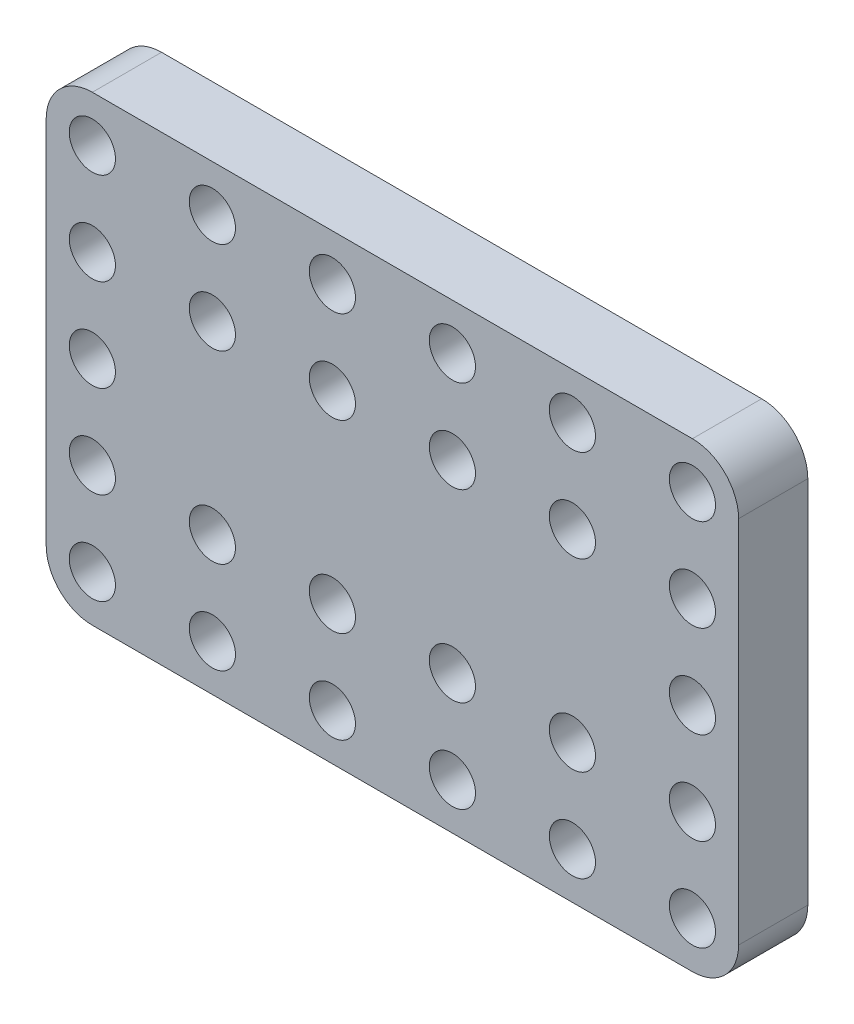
ISO-10303-21;
HEADER;
FILE_DESCRIPTION(('STEP AP214'),'2;1');
FILE_NAME('part.step','',(''),(''),'','','');
FILE_SCHEMA(('AUTOMOTIVE_DESIGN { 1 0 10303 214 1 1 1 1 }'));
ENDSEC;
DATA;
#1=APPLICATION_CONTEXT('core data for automotive mechanical design processes');
#2=APPLICATION_PROTOCOL_DEFINITION('international standard','automotive_design',2000,#1);
#3=PRODUCT_CONTEXT('',#1,'mechanical');
#4=PRODUCT('Part','Part','',(#3));
#5=PRODUCT_RELATED_PRODUCT_CATEGORY('part','',(#4));
#6=PRODUCT_DEFINITION_FORMATION('','',#4);
#7=PRODUCT_DEFINITION_CONTEXT('part definition',#1,'design');
#8=PRODUCT_DEFINITION('design','',#6,#7);
#9=PRODUCT_DEFINITION_SHAPE('','',#8);
#10=(LENGTH_UNIT() NAMED_UNIT(*) SI_UNIT(.MILLI.,.METRE.));
#11=(NAMED_UNIT(*) PLANE_ANGLE_UNIT() SI_UNIT($,.RADIAN.));
#12=(NAMED_UNIT(*) SI_UNIT($,.STERADIAN.) SOLID_ANGLE_UNIT());
#13=UNCERTAINTY_MEASURE_WITH_UNIT(LENGTH_MEASURE(1.E-05),#10,'distance_accuracy_value','');
#14=(GEOMETRIC_REPRESENTATION_CONTEXT(3) GLOBAL_UNCERTAINTY_ASSIGNED_CONTEXT((#13)) GLOBAL_UNIT_ASSIGNED_CONTEXT((#10,
#11,#12)) REPRESENTATION_CONTEXT('',''));
#15=CARTESIAN_POINT('',(0.,0.,0.));
#16=DIRECTION('',(0.,0.,1.));
#17=DIRECTION('',(1.,0.,0.));
#18=AXIS2_PLACEMENT_3D('',#15,#16,#17);
#19=CARTESIAN_POINT('',(10.,90.,7.5));
#20=DIRECTION('',(0.,0.,-1.));
#21=DIRECTION('',(-1.,0.,0.));
#22=AXIS2_PLACEMENT_3D('',#19,#20,#21);
#23=PLANE('',#22);
#24=CARTESIAN_POINT('',(114.,90.,7.5));
#25=DIRECTION('',(0.,0.,1.));
#26=DIRECTION('',(1.,0.,0.));
#27=AXIS2_PLACEMENT_3D('',#24,#25,#26);
#28=CIRCLE('',#27,5.00000000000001);
#29=CARTESIAN_POINT('',(119.,90.,7.5));
#30=VERTEX_POINT('',#29);
#31=EDGE_CURVE('E320',#30,#30,#28,.T.);
#32=ORIENTED_EDGE('',*,*,#31,.F.);
#33=EDGE_LOOP('',(#32));
#34=FACE_BOUND('',#33,.T.);
#35=CARTESIAN_POINT('',(62.,90.,7.5));
#36=DIRECTION('',(0.,0.,1.));
#37=DIRECTION('',(1.,0.,0.));
#38=AXIS2_PLACEMENT_3D('',#35,#36,#37);
#39=CIRCLE('',#38,5.00000000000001);
#40=CARTESIAN_POINT('',(67.,90.,7.5));
#41=VERTEX_POINT('',#40);
#42=EDGE_CURVE('E308',#41,#41,#39,.T.);
#43=ORIENTED_EDGE('',*,*,#42,.F.);
#44=EDGE_LOOP('',(#43));
#45=FACE_BOUND('',#44,.T.);
#46=CARTESIAN_POINT('',(10.,90.,7.5));
#47=DIRECTION('',(0.,0.,1.));
#48=DIRECTION('',(1.,0.,0.));
#49=AXIS2_PLACEMENT_3D('',#46,#47,#48);
#50=CIRCLE('',#49,5.);
#51=CARTESIAN_POINT('',(15.,90.,7.5));
#52=VERTEX_POINT('',#51);
#53=EDGE_CURVE('E296',#52,#52,#50,.T.);
#54=ORIENTED_EDGE('',*,*,#53,.F.);
#55=EDGE_LOOP('',(#54));
#56=FACE_BOUND('',#55,.T.);
#57=CARTESIAN_POINT('',(114.,70.,7.5));
#58=DIRECTION('',(0.,0.,1.));
#59=DIRECTION('',(1.,0.,0.));
#60=AXIS2_PLACEMENT_3D('',#57,#58,#59);
#61=CIRCLE('',#60,5.00000000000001);
#62=CARTESIAN_POINT('',(119.,70.,7.5));
#63=VERTEX_POINT('',#62);
#64=EDGE_CURVE('E284',#63,#63,#61,.T.);
#65=ORIENTED_EDGE('',*,*,#64,.F.);
#66=EDGE_LOOP('',(#65));
#67=FACE_BOUND('',#66,.T.);
#68=CARTESIAN_POINT('',(62.,70.,7.5));
#69=DIRECTION('',(0.,0.,1.));
#70=DIRECTION('',(1.,0.,0.));
#71=AXIS2_PLACEMENT_3D('',#68,#69,#70);
#72=CIRCLE('',#71,5.00000000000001);
#73=CARTESIAN_POINT('',(67.,70.,7.5));
#74=VERTEX_POINT('',#73);
#75=EDGE_CURVE('E272',#74,#74,#72,.T.);
#76=ORIENTED_EDGE('',*,*,#75,.F.);
#77=EDGE_LOOP('',(#76));
#78=FACE_BOUND('',#77,.T.);
#79=CARTESIAN_POINT('',(10.,70.,7.5));
#80=DIRECTION('',(0.,0.,1.));
#81=DIRECTION('',(1.,0.,0.));
#82=AXIS2_PLACEMENT_3D('',#79,#80,#81);
#83=CIRCLE('',#82,5.);
#84=CARTESIAN_POINT('',(15.,70.,7.5));
#85=VERTEX_POINT('',#84);
#86=EDGE_CURVE('E260',#85,#85,#83,.T.);
#87=ORIENTED_EDGE('',*,*,#86,.F.);
#88=EDGE_LOOP('',(#87));
#89=FACE_BOUND('',#88,.T.);
#90=CARTESIAN_POINT('',(10.,50.,7.5));
#91=DIRECTION('',(0.,0.,1.));
#92=DIRECTION('',(1.,0.,0.));
#93=AXIS2_PLACEMENT_3D('',#90,#91,#92);
#94=CIRCLE('',#93,5.);
#95=CARTESIAN_POINT('',(15.,50.,7.5));
#96=VERTEX_POINT('',#95);
#97=EDGE_CURVE('E248',#96,#96,#94,.T.);
#98=ORIENTED_EDGE('',*,*,#97,.F.);
#99=EDGE_LOOP('',(#98));
#100=FACE_BOUND('',#99,.T.);
#101=CARTESIAN_POINT('',(114.,30.,7.5));
#102=DIRECTION('',(0.,0.,1.));
#103=DIRECTION('',(1.,0.,0.));
#104=AXIS2_PLACEMENT_3D('',#101,#102,#103);
#105=CIRCLE('',#104,5.00000000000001);
#106=CARTESIAN_POINT('',(119.,30.,7.5));
#107=VERTEX_POINT('',#106);
#108=EDGE_CURVE('E236',#107,#107,#105,.T.);
#109=ORIENTED_EDGE('',*,*,#108,.F.);
#110=EDGE_LOOP('',(#109));
#111=FACE_BOUND('',#110,.T.);
#112=CARTESIAN_POINT('',(62.,30.,7.5));
#113=DIRECTION('',(0.,0.,1.));
#114=DIRECTION('',(1.,0.,0.));
#115=AXIS2_PLACEMENT_3D('',#112,#113,#114);
#116=CIRCLE('',#115,5.);
#117=CARTESIAN_POINT('',(67.,30.,7.5));
#118=VERTEX_POINT('',#117);
#119=EDGE_CURVE('E224',#118,#118,#116,.T.);
#120=ORIENTED_EDGE('',*,*,#119,.F.);
#121=EDGE_LOOP('',(#120));
#122=FACE_BOUND('',#121,.T.);
#123=CARTESIAN_POINT('',(10.,30.,7.5));
#124=DIRECTION('',(0.,0.,1.));
#125=DIRECTION('',(1.,0.,0.));
#126=AXIS2_PLACEMENT_3D('',#123,#124,#125);
#127=CIRCLE('',#126,5.);
#128=CARTESIAN_POINT('',(15.,30.,7.5));
#129=VERTEX_POINT('',#128);
#130=EDGE_CURVE('E212',#129,#129,#127,.T.);
#131=ORIENTED_EDGE('',*,*,#130,.F.);
#132=EDGE_LOOP('',(#131));
#133=FACE_BOUND('',#132,.T.);
#134=CARTESIAN_POINT('',(114.,10.,7.5));
#135=DIRECTION('',(0.,0.,1.));
#136=DIRECTION('',(1.,0.,0.));
#137=AXIS2_PLACEMENT_3D('',#134,#135,#136);
#138=CIRCLE('',#137,5.);
#139=CARTESIAN_POINT('',(119.,10.,7.5));
#140=VERTEX_POINT('',#139);
#141=EDGE_CURVE('E200',#140,#140,#138,.T.);
#142=ORIENTED_EDGE('',*,*,#141,.F.);
#143=EDGE_LOOP('',(#142));
#144=FACE_BOUND('',#143,.T.);
#145=CARTESIAN_POINT('',(62.,10.,7.5));
#146=DIRECTION('',(0.,0.,1.));
#147=DIRECTION('',(1.,0.,0.));
#148=AXIS2_PLACEMENT_3D('',#145,#146,#147);
#149=CIRCLE('',#148,5.);
#150=CARTESIAN_POINT('',(67.,10.,7.5));
#151=VERTEX_POINT('',#150);
#152=EDGE_CURVE('E188',#151,#151,#149,.T.);
#153=ORIENTED_EDGE('',*,*,#152,.F.);
#154=EDGE_LOOP('',(#153));
#155=FACE_BOUND('',#154,.T.);
#156=CARTESIAN_POINT('',(10.,10.,7.5));
#157=DIRECTION('',(0.,0.,1.));
#158=DIRECTION('',(1.,0.,0.));
#159=AXIS2_PLACEMENT_3D('',#156,#157,#158);
#160=CIRCLE('',#159,5.);
#161=CARTESIAN_POINT('',(15.,10.,7.5));
#162=VERTEX_POINT('',#161);
#163=EDGE_CURVE('E134',#162,#162,#160,.T.);
#164=ORIENTED_EDGE('',*,*,#163,.F.);
#165=EDGE_LOOP('',(#164));
#166=FACE_BOUND('',#165,.T.);
#167=CARTESIAN_POINT('',(10.,90.,7.5));
#168=DIRECTION('',(0.,0.,1.));
#169=DIRECTION('',(-1.,0.,0.));
#170=AXIS2_PLACEMENT_3D('',#167,#168,#169);
#171=CIRCLE('',#170,9.99999999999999);
#172=CARTESIAN_POINT('',(10.,100.,7.5));
#173=VERTEX_POINT('',#172);
#174=CARTESIAN_POINT('',(0.,90.,7.5));
#175=VERTEX_POINT('',#174);
#176=EDGE_CURVE('E145',#173,#175,#171,.T.);
#177=ORIENTED_EDGE('',*,*,#176,.T.);
#178=DIRECTION('',(0.,-1.,0.));
#179=VECTOR('',#178,1.);
#180=CARTESIAN_POINT('',(0.,10.,7.5));
#181=LINE('',#180,#179);
#182=CARTESIAN_POINT('',(0.,10.,7.5));
#183=VERTEX_POINT('',#182);
#184=EDGE_CURVE('E93',#175,#183,#181,.T.);
#185=ORIENTED_EDGE('',*,*,#184,.T.);
#186=CARTESIAN_POINT('',(10.,10.,7.5));
#187=DIRECTION('',(0.,0.,1.));
#188=DIRECTION('',(1.,0.,0.));
#189=AXIS2_PLACEMENT_3D('',#186,#187,#188);
#190=CIRCLE('',#189,10.);
#191=CARTESIAN_POINT('',(10.,0.,7.5));
#192=VERTEX_POINT('',#191);
#193=EDGE_CURVE('E160',#183,#192,#190,.T.);
#194=ORIENTED_EDGE('',*,*,#193,.T.);
#195=DIRECTION('',(1.,0.,0.));
#196=VECTOR('',#195,1.);
#197=CARTESIAN_POINT('',(10.,0.,7.5));
#198=LINE('',#197,#196);
#199=CARTESIAN_POINT('',(140.,0.,7.5));
#200=VERTEX_POINT('',#199);
#201=EDGE_CURVE('E173',#192,#200,#198,.T.);
#202=ORIENTED_EDGE('',*,*,#201,.T.);
#203=CARTESIAN_POINT('',(140.,10.,7.5));
#204=DIRECTION('',(0.,0.,1.));
#205=DIRECTION('',(-1.,0.,0.));
#206=AXIS2_PLACEMENT_3D('',#203,#204,#205);
#207=CIRCLE('',#206,9.99999999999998);
#208=CARTESIAN_POINT('',(150.,10.,7.5));
#209=VERTEX_POINT('',#208);
#210=EDGE_CURVE('E112',#200,#209,#207,.T.);
#211=ORIENTED_EDGE('',*,*,#210,.T.);
#212=DIRECTION('',(0.,1.,0.));
#213=VECTOR('',#212,1.);
#214=CARTESIAN_POINT('',(150.,10.,7.5));
#215=LINE('',#214,#213);
#216=CARTESIAN_POINT('',(150.,90.,7.5));
#217=VERTEX_POINT('',#216);
#218=EDGE_CURVE('E106',#209,#217,#215,.T.);
#219=ORIENTED_EDGE('',*,*,#218,.T.);
#220=CARTESIAN_POINT('',(140.,90.,7.5));
#221=DIRECTION('',(0.,0.,1.));
#222=DIRECTION('',(1.,0.,0.));
#223=AXIS2_PLACEMENT_3D('',#220,#221,#222);
#224=CIRCLE('',#223,9.99999999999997);
#225=CARTESIAN_POINT('',(140.,100.,7.5));
#226=VERTEX_POINT('',#225);
#227=EDGE_CURVE('E110',#217,#226,#224,.T.);
#228=ORIENTED_EDGE('',*,*,#227,.T.);
#229=DIRECTION('',(-1.,0.,0.));
#230=VECTOR('',#229,1.);
#231=CARTESIAN_POINT('',(10.,100.,7.5));
#232=LINE('',#231,#230);
#233=EDGE_CURVE('E50',#226,#173,#232,.T.);
#234=ORIENTED_EDGE('',*,*,#233,.T.);
#235=EDGE_LOOP('',(#177,#185,#194,#202,#211,#219,#228,#234));
#236=FACE_BOUND('',#235,.T.);
#237=CARTESIAN_POINT('',(36.,10.,7.5));
#238=DIRECTION('',(0.,0.,1.));
#239=DIRECTION('',(1.,0.,0.));
#240=AXIS2_PLACEMENT_3D('',#237,#238,#239);
#241=CIRCLE('',#240,5.);
#242=CARTESIAN_POINT('',(41.,10.,7.5));
#243=VERTEX_POINT('',#242);
#244=EDGE_CURVE('E182',#243,#243,#241,.T.);
#245=ORIENTED_EDGE('',*,*,#244,.F.);
#246=EDGE_LOOP('',(#245));
#247=FACE_BOUND('',#246,.T.);
#248=CARTESIAN_POINT('',(88.,10.,7.5));
#249=DIRECTION('',(0.,0.,1.));
#250=DIRECTION('',(1.,0.,0.));
#251=AXIS2_PLACEMENT_3D('',#248,#249,#250);
#252=CIRCLE('',#251,5.);
#253=CARTESIAN_POINT('',(93.,10.,7.5));
#254=VERTEX_POINT('',#253);
#255=EDGE_CURVE('E194',#254,#254,#252,.T.);
#256=ORIENTED_EDGE('',*,*,#255,.F.);
#257=EDGE_LOOP('',(#256));
#258=FACE_BOUND('',#257,.T.);
#259=CARTESIAN_POINT('',(140.,10.,7.5));
#260=DIRECTION('',(0.,0.,1.));
#261=DIRECTION('',(1.,0.,0.));
#262=AXIS2_PLACEMENT_3D('',#259,#260,#261);
#263=CIRCLE('',#262,4.99999999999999);
#264=CARTESIAN_POINT('',(145.,10.,7.5));
#265=VERTEX_POINT('',#264);
#266=EDGE_CURVE('E206',#265,#265,#263,.T.);
#267=ORIENTED_EDGE('',*,*,#266,.F.);
#268=EDGE_LOOP('',(#267));
#269=FACE_BOUND('',#268,.T.);
#270=CARTESIAN_POINT('',(36.,30.,7.5));
#271=DIRECTION('',(0.,0.,1.));
#272=DIRECTION('',(1.,0.,0.));
#273=AXIS2_PLACEMENT_3D('',#270,#271,#272);
#274=CIRCLE('',#273,5.);
#275=CARTESIAN_POINT('',(41.,30.,7.5));
#276=VERTEX_POINT('',#275);
#277=EDGE_CURVE('E218',#276,#276,#274,.T.);
#278=ORIENTED_EDGE('',*,*,#277,.F.);
#279=EDGE_LOOP('',(#278));
#280=FACE_BOUND('',#279,.T.);
#281=CARTESIAN_POINT('',(88.,30.,7.5));
#282=DIRECTION('',(0.,0.,1.));
#283=DIRECTION('',(1.,0.,0.));
#284=AXIS2_PLACEMENT_3D('',#281,#282,#283);
#285=CIRCLE('',#284,5.00000000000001);
#286=CARTESIAN_POINT('',(93.,30.,7.5));
#287=VERTEX_POINT('',#286);
#288=EDGE_CURVE('E230',#287,#287,#285,.T.);
#289=ORIENTED_EDGE('',*,*,#288,.F.);
#290=EDGE_LOOP('',(#289));
#291=FACE_BOUND('',#290,.T.);
#292=CARTESIAN_POINT('',(140.,30.,7.5));
#293=DIRECTION('',(0.,0.,1.));
#294=DIRECTION('',(1.,0.,0.));
#295=AXIS2_PLACEMENT_3D('',#292,#293,#294);
#296=CIRCLE('',#295,4.99999999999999);
#297=CARTESIAN_POINT('',(145.,30.,7.5));
#298=VERTEX_POINT('',#297);
#299=EDGE_CURVE('E242',#298,#298,#296,.T.);
#300=ORIENTED_EDGE('',*,*,#299,.F.);
#301=EDGE_LOOP('',(#300));
#302=FACE_BOUND('',#301,.T.);
#303=CARTESIAN_POINT('',(140.,50.,7.5));
#304=DIRECTION('',(0.,0.,1.));
#305=DIRECTION('',(1.,0.,0.));
#306=AXIS2_PLACEMENT_3D('',#303,#304,#305);
#307=CIRCLE('',#306,4.99999999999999);
#308=CARTESIAN_POINT('',(145.,50.,7.5));
#309=VERTEX_POINT('',#308);
#310=EDGE_CURVE('E254',#309,#309,#307,.T.);
#311=ORIENTED_EDGE('',*,*,#310,.F.);
#312=EDGE_LOOP('',(#311));
#313=FACE_BOUND('',#312,.T.);
#314=CARTESIAN_POINT('',(36.,70.,7.5));
#315=DIRECTION('',(0.,0.,1.));
#316=DIRECTION('',(1.,0.,0.));
#317=AXIS2_PLACEMENT_3D('',#314,#315,#316);
#318=CIRCLE('',#317,5.00000000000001);
#319=CARTESIAN_POINT('',(41.,70.,7.5));
#320=VERTEX_POINT('',#319);
#321=EDGE_CURVE('E266',#320,#320,#318,.T.);
#322=ORIENTED_EDGE('',*,*,#321,.F.);
#323=EDGE_LOOP('',(#322));
#324=FACE_BOUND('',#323,.T.);
#325=CARTESIAN_POINT('',(88.,70.,7.5));
#326=DIRECTION('',(0.,0.,1.));
#327=DIRECTION('',(1.,0.,0.));
#328=AXIS2_PLACEMENT_3D('',#325,#326,#327);
#329=CIRCLE('',#328,5.00000000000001);
#330=CARTESIAN_POINT('',(93.,70.,7.5));
#331=VERTEX_POINT('',#330);
#332=EDGE_CURVE('E278',#331,#331,#329,.T.);
#333=ORIENTED_EDGE('',*,*,#332,.F.);
#334=EDGE_LOOP('',(#333));
#335=FACE_BOUND('',#334,.T.);
#336=CARTESIAN_POINT('',(140.,70.,7.5));
#337=DIRECTION('',(0.,0.,1.));
#338=DIRECTION('',(1.,0.,0.));
#339=AXIS2_PLACEMENT_3D('',#336,#337,#338);
#340=CIRCLE('',#339,4.99999999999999);
#341=CARTESIAN_POINT('',(145.,70.,7.5));
#342=VERTEX_POINT('',#341);
#343=EDGE_CURVE('E290',#342,#342,#340,.T.);
#344=ORIENTED_EDGE('',*,*,#343,.F.);
#345=EDGE_LOOP('',(#344));
#346=FACE_BOUND('',#345,.T.);
#347=CARTESIAN_POINT('',(36.,90.,7.5));
#348=DIRECTION('',(0.,0.,1.));
#349=DIRECTION('',(1.,0.,0.));
#350=AXIS2_PLACEMENT_3D('',#347,#348,#349);
#351=CIRCLE('',#350,5.00000000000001);
#352=CARTESIAN_POINT('',(41.,90.,7.5));
#353=VERTEX_POINT('',#352);
#354=EDGE_CURVE('E302',#353,#353,#351,.T.);
#355=ORIENTED_EDGE('',*,*,#354,.F.);
#356=EDGE_LOOP('',(#355));
#357=FACE_BOUND('',#356,.T.);
#358=CARTESIAN_POINT('',(88.,90.,7.5));
#359=DIRECTION('',(0.,0.,1.));
#360=DIRECTION('',(1.,0.,0.));
#361=AXIS2_PLACEMENT_3D('',#358,#359,#360);
#362=CIRCLE('',#361,5.00000000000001);
#363=CARTESIAN_POINT('',(93.,90.,7.5));
#364=VERTEX_POINT('',#363);
#365=EDGE_CURVE('E314',#364,#364,#362,.T.);
#366=ORIENTED_EDGE('',*,*,#365,.F.);
#367=EDGE_LOOP('',(#366));
#368=FACE_BOUND('',#367,.T.);
#369=CARTESIAN_POINT('',(140.,90.,7.5));
#370=DIRECTION('',(0.,0.,1.));
#371=DIRECTION('',(1.,0.,0.));
#372=AXIS2_PLACEMENT_3D('',#369,#370,#371);
#373=CIRCLE('',#372,4.99999999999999);
#374=CARTESIAN_POINT('',(145.,90.,7.5));
#375=VERTEX_POINT('',#374);
#376=EDGE_CURVE('E326',#375,#375,#373,.T.);
#377=ORIENTED_EDGE('',*,*,#376,.F.);
#378=EDGE_LOOP('',(#377));
#379=FACE_BOUND('',#378,.T.);
#380=ADVANCED_FACE('F33',(#34,#45,#56,#67,#78,#89,#100,#111,#122,#133,#144,#155,#166,#236,#247,
#258,#269,#280,#291,#302,#313,#324,#335,#346,#357,#368,#379),#23,.F.);
#381=CARTESIAN_POINT('',(10.,90.,-7.5));
#382=DIRECTION('',(0.,0.,-1.));
#383=DIRECTION('',(-1.,0.,0.));
#384=AXIS2_PLACEMENT_3D('',#381,#382,#383);
#385=PLANE('',#384);
#386=CARTESIAN_POINT('',(114.,90.,-7.5));
#387=DIRECTION('',(0.,0.,1.));
#388=DIRECTION('',(1.,0.,0.));
#389=AXIS2_PLACEMENT_3D('',#386,#387,#388);
#390=CIRCLE('',#389,5.00000000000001);
#391=CARTESIAN_POINT('',(119.,90.,-7.5));
#392=VERTEX_POINT('',#391);
#393=EDGE_CURVE('E323',#392,#392,#390,.T.);
#394=ORIENTED_EDGE('',*,*,#393,.T.);
#395=EDGE_LOOP('',(#394));
#396=FACE_BOUND('',#395,.T.);
#397=CARTESIAN_POINT('',(62.,90.,-7.5));
#398=DIRECTION('',(0.,0.,1.));
#399=DIRECTION('',(1.,0.,0.));
#400=AXIS2_PLACEMENT_3D('',#397,#398,#399);
#401=CIRCLE('',#400,5.00000000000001);
#402=CARTESIAN_POINT('',(67.,90.,-7.5));
#403=VERTEX_POINT('',#402);
#404=EDGE_CURVE('E311',#403,#403,#401,.T.);
#405=ORIENTED_EDGE('',*,*,#404,.T.);
#406=EDGE_LOOP('',(#405));
#407=FACE_BOUND('',#406,.T.);
#408=CARTESIAN_POINT('',(10.,90.,-7.5));
#409=DIRECTION('',(0.,0.,1.));
#410=DIRECTION('',(1.,0.,0.));
#411=AXIS2_PLACEMENT_3D('',#408,#409,#410);
#412=CIRCLE('',#411,5.);
#413=CARTESIAN_POINT('',(15.,90.,-7.5));
#414=VERTEX_POINT('',#413);
#415=EDGE_CURVE('E299',#414,#414,#412,.T.);
#416=ORIENTED_EDGE('',*,*,#415,.T.);
#417=EDGE_LOOP('',(#416));
#418=FACE_BOUND('',#417,.T.);
#419=CARTESIAN_POINT('',(114.,70.,-7.5));
#420=DIRECTION('',(0.,0.,1.));
#421=DIRECTION('',(1.,0.,0.));
#422=AXIS2_PLACEMENT_3D('',#419,#420,#421);
#423=CIRCLE('',#422,5.00000000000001);
#424=CARTESIAN_POINT('',(119.,70.,-7.5));
#425=VERTEX_POINT('',#424);
#426=EDGE_CURVE('E287',#425,#425,#423,.T.);
#427=ORIENTED_EDGE('',*,*,#426,.T.);
#428=EDGE_LOOP('',(#427));
#429=FACE_BOUND('',#428,.T.);
#430=CARTESIAN_POINT('',(62.,70.,-7.5));
#431=DIRECTION('',(0.,0.,1.));
#432=DIRECTION('',(1.,0.,0.));
#433=AXIS2_PLACEMENT_3D('',#430,#431,#432);
#434=CIRCLE('',#433,5.00000000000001);
#435=CARTESIAN_POINT('',(67.,70.,-7.5));
#436=VERTEX_POINT('',#435);
#437=EDGE_CURVE('E275',#436,#436,#434,.T.);
#438=ORIENTED_EDGE('',*,*,#437,.T.);
#439=EDGE_LOOP('',(#438));
#440=FACE_BOUND('',#439,.T.);
#441=CARTESIAN_POINT('',(10.,70.,-7.5));
#442=DIRECTION('',(0.,0.,1.));
#443=DIRECTION('',(1.,0.,0.));
#444=AXIS2_PLACEMENT_3D('',#441,#442,#443);
#445=CIRCLE('',#444,5.);
#446=CARTESIAN_POINT('',(15.,70.,-7.5));
#447=VERTEX_POINT('',#446);
#448=EDGE_CURVE('E263',#447,#447,#445,.T.);
#449=ORIENTED_EDGE('',*,*,#448,.T.);
#450=EDGE_LOOP('',(#449));
#451=FACE_BOUND('',#450,.T.);
#452=CARTESIAN_POINT('',(10.,50.,-7.5));
#453=DIRECTION('',(0.,0.,1.));
#454=DIRECTION('',(1.,0.,0.));
#455=AXIS2_PLACEMENT_3D('',#452,#453,#454);
#456=CIRCLE('',#455,5.);
#457=CARTESIAN_POINT('',(15.,50.,-7.5));
#458=VERTEX_POINT('',#457);
#459=EDGE_CURVE('E251',#458,#458,#456,.T.);
#460=ORIENTED_EDGE('',*,*,#459,.T.);
#461=EDGE_LOOP('',(#460));
#462=FACE_BOUND('',#461,.T.);
#463=CARTESIAN_POINT('',(114.,30.,-7.5));
#464=DIRECTION('',(0.,0.,1.));
#465=DIRECTION('',(1.,0.,0.));
#466=AXIS2_PLACEMENT_3D('',#463,#464,#465);
#467=CIRCLE('',#466,5.00000000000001);
#468=CARTESIAN_POINT('',(119.,30.,-7.5));
#469=VERTEX_POINT('',#468);
#470=EDGE_CURVE('E239',#469,#469,#467,.T.);
#471=ORIENTED_EDGE('',*,*,#470,.T.);
#472=EDGE_LOOP('',(#471));
#473=FACE_BOUND('',#472,.T.);
#474=CARTESIAN_POINT('',(62.,30.,-7.5));
#475=DIRECTION('',(0.,0.,1.));
#476=DIRECTION('',(1.,0.,0.));
#477=AXIS2_PLACEMENT_3D('',#474,#475,#476);
#478=CIRCLE('',#477,5.);
#479=CARTESIAN_POINT('',(67.,30.,-7.5));
#480=VERTEX_POINT('',#479);
#481=EDGE_CURVE('E227',#480,#480,#478,.T.);
#482=ORIENTED_EDGE('',*,*,#481,.T.);
#483=EDGE_LOOP('',(#482));
#484=FACE_BOUND('',#483,.T.);
#485=CARTESIAN_POINT('',(10.,30.,-7.5));
#486=DIRECTION('',(0.,0.,1.));
#487=DIRECTION('',(1.,0.,0.));
#488=AXIS2_PLACEMENT_3D('',#485,#486,#487);
#489=CIRCLE('',#488,5.);
#490=CARTESIAN_POINT('',(15.,30.,-7.5));
#491=VERTEX_POINT('',#490);
#492=EDGE_CURVE('E215',#491,#491,#489,.T.);
#493=ORIENTED_EDGE('',*,*,#492,.T.);
#494=EDGE_LOOP('',(#493));
#495=FACE_BOUND('',#494,.T.);
#496=CARTESIAN_POINT('',(114.,10.,-7.5));
#497=DIRECTION('',(0.,0.,1.));
#498=DIRECTION('',(1.,0.,0.));
#499=AXIS2_PLACEMENT_3D('',#496,#497,#498);
#500=CIRCLE('',#499,5.);
#501=CARTESIAN_POINT('',(119.,10.,-7.5));
#502=VERTEX_POINT('',#501);
#503=EDGE_CURVE('E203',#502,#502,#500,.T.);
#504=ORIENTED_EDGE('',*,*,#503,.T.);
#505=EDGE_LOOP('',(#504));
#506=FACE_BOUND('',#505,.T.);
#507=CARTESIAN_POINT('',(62.,10.,-7.5));
#508=DIRECTION('',(0.,0.,1.));
#509=DIRECTION('',(1.,0.,0.));
#510=AXIS2_PLACEMENT_3D('',#507,#508,#509);
#511=CIRCLE('',#510,5.);
#512=CARTESIAN_POINT('',(67.,10.,-7.5));
#513=VERTEX_POINT('',#512);
#514=EDGE_CURVE('E191',#513,#513,#511,.T.);
#515=ORIENTED_EDGE('',*,*,#514,.T.);
#516=EDGE_LOOP('',(#515));
#517=FACE_BOUND('',#516,.T.);
#518=CARTESIAN_POINT('',(10.,10.,-7.5));
#519=DIRECTION('',(0.,0.,1.));
#520=DIRECTION('',(1.,0.,0.));
#521=AXIS2_PLACEMENT_3D('',#518,#519,#520);
#522=CIRCLE('',#521,5.);
#523=CARTESIAN_POINT('',(15.,10.,-7.5));
#524=VERTEX_POINT('',#523);
#525=EDGE_CURVE('E179',#524,#524,#522,.T.);
#526=ORIENTED_EDGE('',*,*,#525,.T.);
#527=EDGE_LOOP('',(#526));
#528=FACE_BOUND('',#527,.T.);
#529=CARTESIAN_POINT('',(10.,90.,-7.5));
#530=DIRECTION('',(0.,0.,1.));
#531=DIRECTION('',(-1.,0.,0.));
#532=AXIS2_PLACEMENT_3D('',#529,#530,#531);
#533=CIRCLE('',#532,9.99999999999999);
#534=CARTESIAN_POINT('',(10.,100.,-7.5));
#535=VERTEX_POINT('',#534);
#536=CARTESIAN_POINT('',(0.,90.,-7.5));
#537=VERTEX_POINT('',#536);
#538=EDGE_CURVE('E130',#535,#537,#533,.T.);
#539=ORIENTED_EDGE('',*,*,#538,.F.);
#540=DIRECTION('',(-1.,0.,0.));
#541=VECTOR('',#540,1.);
#542=CARTESIAN_POINT('',(10.,100.,-7.5));
#543=LINE('',#542,#541);
#544=CARTESIAN_POINT('',(140.,100.,-7.5));
#545=VERTEX_POINT('',#544);
#546=EDGE_CURVE('E85',#545,#535,#543,.T.);
#547=ORIENTED_EDGE('',*,*,#546,.F.);
#548=CARTESIAN_POINT('',(140.,90.,-7.5));
#549=DIRECTION('',(0.,0.,1.));
#550=DIRECTION('',(1.,0.,0.));
#551=AXIS2_PLACEMENT_3D('',#548,#549,#550);
#552=CIRCLE('',#551,9.99999999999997);
#553=CARTESIAN_POINT('',(150.,90.,-7.5));
#554=VERTEX_POINT('',#553);
#555=EDGE_CURVE('E79',#554,#545,#552,.T.);
#556=ORIENTED_EDGE('',*,*,#555,.F.);
#557=DIRECTION('',(0.,1.,0.));
#558=VECTOR('',#557,1.);
#559=CARTESIAN_POINT('',(150.,10.,-7.5));
#560=LINE('',#559,#558);
#561=CARTESIAN_POINT('',(150.,10.,-7.5));
#562=VERTEX_POINT('',#561);
#563=EDGE_CURVE('E120',#562,#554,#560,.T.);
#564=ORIENTED_EDGE('',*,*,#563,.F.);
#565=CARTESIAN_POINT('',(140.,10.,-7.5));
#566=DIRECTION('',(0.,0.,1.));
#567=DIRECTION('',(-1.,0.,0.));
#568=AXIS2_PLACEMENT_3D('',#565,#566,#567);
#569=CIRCLE('',#568,9.99999999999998);
#570=CARTESIAN_POINT('',(140.,0.,-7.5));
#571=VERTEX_POINT('',#570);
#572=EDGE_CURVE('E140',#571,#562,#569,.T.);
#573=ORIENTED_EDGE('',*,*,#572,.F.);
#574=DIRECTION('',(1.,0.,0.));
#575=VECTOR('',#574,1.);
#576=CARTESIAN_POINT('',(10.,0.,-7.5));
#577=LINE('',#576,#575);
#578=CARTESIAN_POINT('',(10.,0.,-7.5));
#579=VERTEX_POINT('',#578);
#580=EDGE_CURVE('E138',#579,#571,#577,.T.);
#581=ORIENTED_EDGE('',*,*,#580,.F.);
#582=CARTESIAN_POINT('',(10.,10.,-7.5));
#583=DIRECTION('',(0.,0.,1.));
#584=DIRECTION('',(1.,0.,0.));
#585=AXIS2_PLACEMENT_3D('',#582,#583,#584);
#586=CIRCLE('',#585,10.);
#587=CARTESIAN_POINT('',(0.,10.,-7.5));
#588=VERTEX_POINT('',#587);
#589=EDGE_CURVE('E136',#588,#579,#586,.T.);
#590=ORIENTED_EDGE('',*,*,#589,.F.);
#591=DIRECTION('',(0.,-1.,0.));
#592=VECTOR('',#591,1.);
#593=CARTESIAN_POINT('',(0.,10.,-7.5));
#594=LINE('',#593,#592);
#595=EDGE_CURVE('E133',#537,#588,#594,.T.);
#596=ORIENTED_EDGE('',*,*,#595,.F.);
#597=EDGE_LOOP('',(#539,#547,#556,#564,#573,#581,#590,#596));
#598=FACE_BOUND('',#597,.T.);
#599=CARTESIAN_POINT('',(36.,10.,-7.5));
#600=DIRECTION('',(0.,0.,1.));
#601=DIRECTION('',(1.,0.,0.));
#602=AXIS2_PLACEMENT_3D('',#599,#600,#601);
#603=CIRCLE('',#602,5.);
#604=CARTESIAN_POINT('',(41.,10.,-7.5));
#605=VERTEX_POINT('',#604);
#606=EDGE_CURVE('E185',#605,#605,#603,.T.);
#607=ORIENTED_EDGE('',*,*,#606,.T.);
#608=EDGE_LOOP('',(#607));
#609=FACE_BOUND('',#608,.T.);
#610=CARTESIAN_POINT('',(88.,10.,-7.5));
#611=DIRECTION('',(0.,0.,1.));
#612=DIRECTION('',(1.,0.,0.));
#613=AXIS2_PLACEMENT_3D('',#610,#611,#612);
#614=CIRCLE('',#613,5.);
#615=CARTESIAN_POINT('',(93.,10.,-7.5));
#616=VERTEX_POINT('',#615);
#617=EDGE_CURVE('E197',#616,#616,#614,.T.);
#618=ORIENTED_EDGE('',*,*,#617,.T.);
#619=EDGE_LOOP('',(#618));
#620=FACE_BOUND('',#619,.T.);
#621=CARTESIAN_POINT('',(140.,10.,-7.5));
#622=DIRECTION('',(0.,0.,1.));
#623=DIRECTION('',(1.,0.,0.));
#624=AXIS2_PLACEMENT_3D('',#621,#622,#623);
#625=CIRCLE('',#624,4.99999999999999);
#626=CARTESIAN_POINT('',(145.,10.,-7.5));
#627=VERTEX_POINT('',#626);
#628=EDGE_CURVE('E209',#627,#627,#625,.T.);
#629=ORIENTED_EDGE('',*,*,#628,.T.);
#630=EDGE_LOOP('',(#629));
#631=FACE_BOUND('',#630,.T.);
#632=CARTESIAN_POINT('',(36.,30.,-7.5));
#633=DIRECTION('',(0.,0.,1.));
#634=DIRECTION('',(1.,0.,0.));
#635=AXIS2_PLACEMENT_3D('',#632,#633,#634);
#636=CIRCLE('',#635,5.);
#637=CARTESIAN_POINT('',(41.,30.,-7.5));
#638=VERTEX_POINT('',#637);
#639=EDGE_CURVE('E221',#638,#638,#636,.T.);
#640=ORIENTED_EDGE('',*,*,#639,.T.);
#641=EDGE_LOOP('',(#640));
#642=FACE_BOUND('',#641,.T.);
#643=CARTESIAN_POINT('',(88.,30.,-7.5));
#644=DIRECTION('',(0.,0.,1.));
#645=DIRECTION('',(1.,0.,0.));
#646=AXIS2_PLACEMENT_3D('',#643,#644,#645);
#647=CIRCLE('',#646,5.00000000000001);
#648=CARTESIAN_POINT('',(93.,30.,-7.5));
#649=VERTEX_POINT('',#648);
#650=EDGE_CURVE('E233',#649,#649,#647,.T.);
#651=ORIENTED_EDGE('',*,*,#650,.T.);
#652=EDGE_LOOP('',(#651));
#653=FACE_BOUND('',#652,.T.);
#654=CARTESIAN_POINT('',(140.,30.,-7.5));
#655=DIRECTION('',(0.,0.,1.));
#656=DIRECTION('',(1.,0.,0.));
#657=AXIS2_PLACEMENT_3D('',#654,#655,#656);
#658=CIRCLE('',#657,4.99999999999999);
#659=CARTESIAN_POINT('',(145.,30.,-7.5));
#660=VERTEX_POINT('',#659);
#661=EDGE_CURVE('E245',#660,#660,#658,.T.);
#662=ORIENTED_EDGE('',*,*,#661,.T.);
#663=EDGE_LOOP('',(#662));
#664=FACE_BOUND('',#663,.T.);
#665=CARTESIAN_POINT('',(140.,50.,-7.5));
#666=DIRECTION('',(0.,0.,1.));
#667=DIRECTION('',(1.,0.,0.));
#668=AXIS2_PLACEMENT_3D('',#665,#666,#667);
#669=CIRCLE('',#668,4.99999999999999);
#670=CARTESIAN_POINT('',(145.,50.,-7.5));
#671=VERTEX_POINT('',#670);
#672=EDGE_CURVE('E257',#671,#671,#669,.T.);
#673=ORIENTED_EDGE('',*,*,#672,.T.);
#674=EDGE_LOOP('',(#673));
#675=FACE_BOUND('',#674,.T.);
#676=CARTESIAN_POINT('',(36.,70.,-7.5));
#677=DIRECTION('',(0.,0.,1.));
#678=DIRECTION('',(1.,0.,0.));
#679=AXIS2_PLACEMENT_3D('',#676,#677,#678);
#680=CIRCLE('',#679,5.00000000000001);
#681=CARTESIAN_POINT('',(41.,70.,-7.5));
#682=VERTEX_POINT('',#681);
#683=EDGE_CURVE('E269',#682,#682,#680,.T.);
#684=ORIENTED_EDGE('',*,*,#683,.T.);
#685=EDGE_LOOP('',(#684));
#686=FACE_BOUND('',#685,.T.);
#687=CARTESIAN_POINT('',(88.,70.,-7.5));
#688=DIRECTION('',(0.,0.,1.));
#689=DIRECTION('',(1.,0.,0.));
#690=AXIS2_PLACEMENT_3D('',#687,#688,#689);
#691=CIRCLE('',#690,5.00000000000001);
#692=CARTESIAN_POINT('',(93.,70.,-7.5));
#693=VERTEX_POINT('',#692);
#694=EDGE_CURVE('E281',#693,#693,#691,.T.);
#695=ORIENTED_EDGE('',*,*,#694,.T.);
#696=EDGE_LOOP('',(#695));
#697=FACE_BOUND('',#696,.T.);
#698=CARTESIAN_POINT('',(140.,70.,-7.5));
#699=DIRECTION('',(0.,0.,1.));
#700=DIRECTION('',(1.,0.,0.));
#701=AXIS2_PLACEMENT_3D('',#698,#699,#700);
#702=CIRCLE('',#701,4.99999999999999);
#703=CARTESIAN_POINT('',(145.,70.,-7.5));
#704=VERTEX_POINT('',#703);
#705=EDGE_CURVE('E293',#704,#704,#702,.T.);
#706=ORIENTED_EDGE('',*,*,#705,.T.);
#707=EDGE_LOOP('',(#706));
#708=FACE_BOUND('',#707,.T.);
#709=CARTESIAN_POINT('',(36.,90.,-7.5));
#710=DIRECTION('',(0.,0.,1.));
#711=DIRECTION('',(1.,0.,0.));
#712=AXIS2_PLACEMENT_3D('',#709,#710,#711);
#713=CIRCLE('',#712,5.00000000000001);
#714=CARTESIAN_POINT('',(41.,90.,-7.5));
#715=VERTEX_POINT('',#714);
#716=EDGE_CURVE('E305',#715,#715,#713,.T.);
#717=ORIENTED_EDGE('',*,*,#716,.T.);
#718=EDGE_LOOP('',(#717));
#719=FACE_BOUND('',#718,.T.);
#720=CARTESIAN_POINT('',(88.,90.,-7.5));
#721=DIRECTION('',(0.,0.,1.));
#722=DIRECTION('',(1.,0.,0.));
#723=AXIS2_PLACEMENT_3D('',#720,#721,#722);
#724=CIRCLE('',#723,5.00000000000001);
#725=CARTESIAN_POINT('',(93.,90.,-7.5));
#726=VERTEX_POINT('',#725);
#727=EDGE_CURVE('E317',#726,#726,#724,.T.);
#728=ORIENTED_EDGE('',*,*,#727,.T.);
#729=EDGE_LOOP('',(#728));
#730=FACE_BOUND('',#729,.T.);
#731=CARTESIAN_POINT('',(140.,90.,-7.5));
#732=DIRECTION('',(0.,0.,1.));
#733=DIRECTION('',(1.,0.,0.));
#734=AXIS2_PLACEMENT_3D('',#731,#732,#733);
#735=CIRCLE('',#734,4.99999999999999);
#736=CARTESIAN_POINT('',(145.,90.,-7.5));
#737=VERTEX_POINT('',#736);
#738=EDGE_CURVE('E329',#737,#737,#735,.T.);
#739=ORIENTED_EDGE('',*,*,#738,.T.);
#740=EDGE_LOOP('',(#739));
#741=FACE_BOUND('',#740,.T.);
#742=ADVANCED_FACE('F164',(#396,#407,#418,#429,#440,#451,#462,#473,#484,#495,#506,#517,#528,
#598,#609,#620,#631,#642,#653,#664,#675,#686,#697,#708,#719,#730,#741),#385,.T.);
#743=CARTESIAN_POINT('',(10.,90.,7.5));
#744=DIRECTION('',(0.,0.,-1.));
#745=DIRECTION('',(-1.,0.,0.));
#746=AXIS2_PLACEMENT_3D('',#743,#744,#745);
#747=CYLINDRICAL_SURFACE('',#746,9.99999999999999);
#748=ORIENTED_EDGE('',*,*,#538,.T.);
#749=DIRECTION('',(0.,0.,-1.));
#750=VECTOR('',#749,1.);
#751=CARTESIAN_POINT('',(0.,90.,7.5));
#752=LINE('',#751,#750);
#753=EDGE_CURVE('E11',#175,#537,#752,.T.);
#754=ORIENTED_EDGE('',*,*,#753,.F.);
#755=ORIENTED_EDGE('',*,*,#176,.F.);
#756=DIRECTION('',(0.,0.,-1.));
#757=VECTOR('',#756,1.);
#758=CARTESIAN_POINT('',(10.,100.,7.5));
#759=LINE('',#758,#757);
#760=EDGE_CURVE('E126',#173,#535,#759,.T.);
#761=ORIENTED_EDGE('',*,*,#760,.T.);
#762=EDGE_LOOP('',(#748,#754,#755,#761));
#763=FACE_BOUND('',#762,.T.);
#764=ADVANCED_FACE('F35',(#763),#747,.T.);
#765=CARTESIAN_POINT('',(0.,10.,7.5));
#766=DIRECTION('',(1.,0.,0.));
#767=DIRECTION('',(0.,0.,-1.));
#768=AXIS2_PLACEMENT_3D('',#765,#766,#767);
#769=PLANE('',#768);
#770=ORIENTED_EDGE('',*,*,#595,.T.);
#771=DIRECTION('',(0.,0.,-1.));
#772=VECTOR('',#771,1.);
#773=CARTESIAN_POINT('',(0.,10.,7.5));
#774=LINE('',#773,#772);
#775=EDGE_CURVE('E42',#183,#588,#774,.T.);
#776=ORIENTED_EDGE('',*,*,#775,.F.);
#777=ORIENTED_EDGE('',*,*,#184,.F.);
#778=ORIENTED_EDGE('',*,*,#753,.T.);
#779=EDGE_LOOP('',(#770,#776,#777,#778));
#780=FACE_BOUND('',#779,.T.);
#781=ADVANCED_FACE('F364',(#780),#769,.F.);
#782=CARTESIAN_POINT('',(10.,10.,7.5));
#783=DIRECTION('',(0.,0.,-1.));
#784=DIRECTION('',(-1.,0.,0.));
#785=AXIS2_PLACEMENT_3D('',#782,#783,#784);
#786=CYLINDRICAL_SURFACE('',#785,10.);
#787=ORIENTED_EDGE('',*,*,#589,.T.);
#788=DIRECTION('',(0.,0.,-1.));
#789=VECTOR('',#788,1.);
#790=CARTESIAN_POINT('',(10.,0.,7.5));
#791=LINE('',#790,#789);
#792=EDGE_CURVE('E152',#192,#579,#791,.T.);
#793=ORIENTED_EDGE('',*,*,#792,.F.);
#794=ORIENTED_EDGE('',*,*,#193,.F.);
#795=ORIENTED_EDGE('',*,*,#775,.T.);
#796=EDGE_LOOP('',(#787,#793,#794,#795));
#797=FACE_BOUND('',#796,.T.);
#798=ADVANCED_FACE('F158',(#797),#786,.T.);
#799=CARTESIAN_POINT('',(10.,0.,7.5));
#800=DIRECTION('',(0.,1.,0.));
#801=DIRECTION('',(0.,0.,1.));
#802=AXIS2_PLACEMENT_3D('',#799,#800,#801);
#803=PLANE('',#802);
#804=ORIENTED_EDGE('',*,*,#580,.T.);
#805=DIRECTION('',(0.,0.,-1.));
#806=VECTOR('',#805,1.);
#807=CARTESIAN_POINT('',(140.,0.,7.5));
#808=LINE('',#807,#806);
#809=EDGE_CURVE('E149',#200,#571,#808,.T.);
#810=ORIENTED_EDGE('',*,*,#809,.F.);
#811=ORIENTED_EDGE('',*,*,#201,.F.);
#812=ORIENTED_EDGE('',*,*,#792,.T.);
#813=EDGE_LOOP('',(#804,#810,#811,#812));
#814=FACE_BOUND('',#813,.T.);
#815=ADVANCED_FACE('F169',(#814),#803,.F.);
#816=CARTESIAN_POINT('',(140.,10.,7.5));
#817=DIRECTION('',(0.,0.,-1.));
#818=DIRECTION('',(-1.,0.,0.));
#819=AXIS2_PLACEMENT_3D('',#816,#817,#818);
#820=CYLINDRICAL_SURFACE('',#819,9.99999999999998);
#821=ORIENTED_EDGE('',*,*,#572,.T.);
#822=DIRECTION('',(0.,0.,-1.));
#823=VECTOR('',#822,1.);
#824=CARTESIAN_POINT('',(150.,10.,7.5));
#825=LINE('',#824,#823);
#826=EDGE_CURVE('E121',#209,#562,#825,.T.);
#827=ORIENTED_EDGE('',*,*,#826,.F.);
#828=ORIENTED_EDGE('',*,*,#210,.F.);
#829=ORIENTED_EDGE('',*,*,#809,.T.);
#830=EDGE_LOOP('',(#821,#827,#828,#829));
#831=FACE_BOUND('',#830,.T.);
#832=ADVANCED_FACE('F172',(#831),#820,.T.);
#833=CARTESIAN_POINT('',(150.,10.,7.5));
#834=DIRECTION('',(-1.,0.,0.));
#835=DIRECTION('',(0.,0.,1.));
#836=AXIS2_PLACEMENT_3D('',#833,#834,#835);
#837=PLANE('',#836);
#838=ORIENTED_EDGE('',*,*,#563,.T.);
#839=DIRECTION('',(0.,0.,-1.));
#840=VECTOR('',#839,1.);
#841=CARTESIAN_POINT('',(150.,90.,7.5));
#842=LINE('',#841,#840);
#843=EDGE_CURVE('E117',#217,#554,#842,.T.);
#844=ORIENTED_EDGE('',*,*,#843,.F.);
#845=ORIENTED_EDGE('',*,*,#218,.F.);
#846=ORIENTED_EDGE('',*,*,#826,.T.);
#847=EDGE_LOOP('',(#838,#844,#845,#846));
#848=FACE_BOUND('',#847,.T.);
#849=ADVANCED_FACE('F118',(#848),#837,.F.);
#850=CARTESIAN_POINT('',(140.,90.,7.5));
#851=DIRECTION('',(0.,0.,-1.));
#852=DIRECTION('',(-1.,0.,0.));
#853=AXIS2_PLACEMENT_3D('',#850,#851,#852);
#854=CYLINDRICAL_SURFACE('',#853,9.99999999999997);
#855=ORIENTED_EDGE('',*,*,#555,.T.);
#856=DIRECTION('',(0.,0.,-1.));
#857=VECTOR('',#856,1.);
#858=CARTESIAN_POINT('',(140.,100.,7.5));
#859=LINE('',#858,#857);
#860=EDGE_CURVE('E122',#226,#545,#859,.T.);
#861=ORIENTED_EDGE('',*,*,#860,.F.);
#862=ORIENTED_EDGE('',*,*,#227,.F.);
#863=ORIENTED_EDGE('',*,*,#843,.T.);
#864=EDGE_LOOP('',(#855,#861,#862,#863));
#865=FACE_BOUND('',#864,.T.);
#866=ADVANCED_FACE('F124',(#865),#854,.T.);
#867=CARTESIAN_POINT('',(10.,100.,7.5));
#868=DIRECTION('',(0.,-1.,0.));
#869=DIRECTION('',(0.,0.,-1.));
#870=AXIS2_PLACEMENT_3D('',#867,#868,#869);
#871=PLANE('',#870);
#872=ORIENTED_EDGE('',*,*,#546,.T.);
#873=ORIENTED_EDGE('',*,*,#760,.F.);
#874=ORIENTED_EDGE('',*,*,#233,.F.);
#875=ORIENTED_EDGE('',*,*,#860,.T.);
#876=EDGE_LOOP('',(#872,#873,#874,#875));
#877=FACE_BOUND('',#876,.T.);
#878=ADVANCED_FACE('F352',(#877),#871,.F.);
#879=CARTESIAN_POINT('',(10.,10.,7.5));
#880=DIRECTION('',(0.,0.,-1.));
#881=DIRECTION('',(-1.,0.,0.));
#882=AXIS2_PLACEMENT_3D('',#879,#880,#881);
#883=CYLINDRICAL_SURFACE('',#882,5.);
#884=ORIENTED_EDGE('',*,*,#163,.T.);
#885=EDGE_LOOP('',(#884));
#886=FACE_BOUND('',#885,.T.);
#887=ORIENTED_EDGE('',*,*,#525,.F.);
#888=EDGE_LOOP('',(#887));
#889=FACE_BOUND('',#888,.T.);
#890=ADVANCED_FACE('F349',(#886,#889),#883,.F.);
#891=CARTESIAN_POINT('',(36.,10.,7.5));
#892=DIRECTION('',(0.,0.,-1.));
#893=DIRECTION('',(-1.,0.,0.));
#894=AXIS2_PLACEMENT_3D('',#891,#892,#893);
#895=CYLINDRICAL_SURFACE('',#894,5.);
#896=ORIENTED_EDGE('',*,*,#244,.T.);
#897=EDGE_LOOP('',(#896));
#898=FACE_BOUND('',#897,.T.);
#899=ORIENTED_EDGE('',*,*,#606,.F.);
#900=EDGE_LOOP('',(#899));
#901=FACE_BOUND('',#900,.T.);
#902=ADVANCED_FACE('F428',(#898,#901),#895,.F.);
#903=CARTESIAN_POINT('',(62.,10.,7.5));
#904=DIRECTION('',(0.,0.,-1.));
#905=DIRECTION('',(-1.,0.,0.));
#906=AXIS2_PLACEMENT_3D('',#903,#904,#905);
#907=CYLINDRICAL_SURFACE('',#906,5.);
#908=ORIENTED_EDGE('',*,*,#152,.T.);
#909=EDGE_LOOP('',(#908));
#910=FACE_BOUND('',#909,.T.);
#911=ORIENTED_EDGE('',*,*,#514,.F.);
#912=EDGE_LOOP('',(#911));
#913=FACE_BOUND('',#912,.T.);
#914=ADVANCED_FACE('F436',(#910,#913),#907,.F.);
#915=CARTESIAN_POINT('',(88.,10.,7.5));
#916=DIRECTION('',(0.,0.,-1.));
#917=DIRECTION('',(-1.,0.,0.));
#918=AXIS2_PLACEMENT_3D('',#915,#916,#917);
#919=CYLINDRICAL_SURFACE('',#918,5.);
#920=ORIENTED_EDGE('',*,*,#255,.T.);
#921=EDGE_LOOP('',(#920));
#922=FACE_BOUND('',#921,.T.);
#923=ORIENTED_EDGE('',*,*,#617,.F.);
#924=EDGE_LOOP('',(#923));
#925=FACE_BOUND('',#924,.T.);
#926=ADVANCED_FACE('F444',(#922,#925),#919,.F.);
#927=CARTESIAN_POINT('',(114.,10.,7.5));
#928=DIRECTION('',(0.,0.,-1.));
#929=DIRECTION('',(-1.,0.,0.));
#930=AXIS2_PLACEMENT_3D('',#927,#928,#929);
#931=CYLINDRICAL_SURFACE('',#930,5.);
#932=ORIENTED_EDGE('',*,*,#141,.T.);
#933=EDGE_LOOP('',(#932));
#934=FACE_BOUND('',#933,.T.);
#935=ORIENTED_EDGE('',*,*,#503,.F.);
#936=EDGE_LOOP('',(#935));
#937=FACE_BOUND('',#936,.T.);
#938=ADVANCED_FACE('F453',(#934,#937),#931,.F.);
#939=CARTESIAN_POINT('',(140.,10.,7.5));
#940=DIRECTION('',(0.,0.,-1.));
#941=DIRECTION('',(-1.,0.,0.));
#942=AXIS2_PLACEMENT_3D('',#939,#940,#941);
#943=CYLINDRICAL_SURFACE('',#942,4.99999999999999);
#944=ORIENTED_EDGE('',*,*,#266,.T.);
#945=EDGE_LOOP('',(#944));
#946=FACE_BOUND('',#945,.T.);
#947=ORIENTED_EDGE('',*,*,#628,.F.);
#948=EDGE_LOOP('',(#947));
#949=FACE_BOUND('',#948,.T.);
#950=ADVANCED_FACE('F462',(#946,#949),#943,.F.);
#951=CARTESIAN_POINT('',(10.,30.,7.5));
#952=DIRECTION('',(0.,0.,-1.));
#953=DIRECTION('',(-1.,0.,0.));
#954=AXIS2_PLACEMENT_3D('',#951,#952,#953);
#955=CYLINDRICAL_SURFACE('',#954,5.);
#956=ORIENTED_EDGE('',*,*,#130,.T.);
#957=EDGE_LOOP('',(#956));
#958=FACE_BOUND('',#957,.T.);
#959=ORIENTED_EDGE('',*,*,#492,.F.);
#960=EDGE_LOOP('',(#959));
#961=FACE_BOUND('',#960,.T.);
#962=ADVANCED_FACE('F471',(#958,#961),#955,.F.);
#963=CARTESIAN_POINT('',(36.,30.,7.5));
#964=DIRECTION('',(0.,0.,-1.));
#965=DIRECTION('',(-1.,0.,0.));
#966=AXIS2_PLACEMENT_3D('',#963,#964,#965);
#967=CYLINDRICAL_SURFACE('',#966,5.);
#968=ORIENTED_EDGE('',*,*,#277,.T.);
#969=EDGE_LOOP('',(#968));
#970=FACE_BOUND('',#969,.T.);
#971=ORIENTED_EDGE('',*,*,#639,.F.);
#972=EDGE_LOOP('',(#971));
#973=FACE_BOUND('',#972,.T.);
#974=ADVANCED_FACE('F480',(#970,#973),#967,.F.);
#975=CARTESIAN_POINT('',(62.,30.,7.5));
#976=DIRECTION('',(0.,0.,-1.));
#977=DIRECTION('',(-1.,0.,0.));
#978=AXIS2_PLACEMENT_3D('',#975,#976,#977);
#979=CYLINDRICAL_SURFACE('',#978,5.);
#980=ORIENTED_EDGE('',*,*,#119,.T.);
#981=EDGE_LOOP('',(#980));
#982=FACE_BOUND('',#981,.T.);
#983=ORIENTED_EDGE('',*,*,#481,.F.);
#984=EDGE_LOOP('',(#983));
#985=FACE_BOUND('',#984,.T.);
#986=ADVANCED_FACE('F489',(#982,#985),#979,.F.);
#987=CARTESIAN_POINT('',(88.,30.,7.5));
#988=DIRECTION('',(0.,0.,-1.));
#989=DIRECTION('',(-1.,0.,0.));
#990=AXIS2_PLACEMENT_3D('',#987,#988,#989);
#991=CYLINDRICAL_SURFACE('',#990,5.00000000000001);
#992=ORIENTED_EDGE('',*,*,#288,.T.);
#993=EDGE_LOOP('',(#992));
#994=FACE_BOUND('',#993,.T.);
#995=ORIENTED_EDGE('',*,*,#650,.F.);
#996=EDGE_LOOP('',(#995));
#997=FACE_BOUND('',#996,.T.);
#998=ADVANCED_FACE('F498',(#994,#997),#991,.F.);
#999=CARTESIAN_POINT('',(114.,30.,7.5));
#1000=DIRECTION('',(0.,0.,-1.));
#1001=DIRECTION('',(-1.,0.,0.));
#1002=AXIS2_PLACEMENT_3D('',#999,#1000,#1001);
#1003=CYLINDRICAL_SURFACE('',#1002,5.00000000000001);
#1004=ORIENTED_EDGE('',*,*,#108,.T.);
#1005=EDGE_LOOP('',(#1004));
#1006=FACE_BOUND('',#1005,.T.);
#1007=ORIENTED_EDGE('',*,*,#470,.F.);
#1008=EDGE_LOOP('',(#1007));
#1009=FACE_BOUND('',#1008,.T.);
#1010=ADVANCED_FACE('F507',(#1006,#1009),#1003,.F.);
#1011=CARTESIAN_POINT('',(140.,30.,7.5));
#1012=DIRECTION('',(0.,0.,-1.));
#1013=DIRECTION('',(-1.,0.,0.));
#1014=AXIS2_PLACEMENT_3D('',#1011,#1012,#1013);
#1015=CYLINDRICAL_SURFACE('',#1014,4.99999999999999);
#1016=ORIENTED_EDGE('',*,*,#299,.T.);
#1017=EDGE_LOOP('',(#1016));
#1018=FACE_BOUND('',#1017,.T.);
#1019=ORIENTED_EDGE('',*,*,#661,.F.);
#1020=EDGE_LOOP('',(#1019));
#1021=FACE_BOUND('',#1020,.T.);
#1022=ADVANCED_FACE('F516',(#1018,#1021),#1015,.F.);
#1023=CARTESIAN_POINT('',(10.,50.,7.5));
#1024=DIRECTION('',(0.,0.,-1.));
#1025=DIRECTION('',(-1.,0.,0.));
#1026=AXIS2_PLACEMENT_3D('',#1023,#1024,#1025);
#1027=CYLINDRICAL_SURFACE('',#1026,5.);
#1028=ORIENTED_EDGE('',*,*,#97,.T.);
#1029=EDGE_LOOP('',(#1028));
#1030=FACE_BOUND('',#1029,.T.);
#1031=ORIENTED_EDGE('',*,*,#459,.F.);
#1032=EDGE_LOOP('',(#1031));
#1033=FACE_BOUND('',#1032,.T.);
#1034=ADVANCED_FACE('F525',(#1030,#1033),#1027,.F.);
#1035=CARTESIAN_POINT('',(140.,50.,7.5));
#1036=DIRECTION('',(0.,0.,-1.));
#1037=DIRECTION('',(-1.,0.,0.));
#1038=AXIS2_PLACEMENT_3D('',#1035,#1036,#1037);
#1039=CYLINDRICAL_SURFACE('',#1038,4.99999999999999);
#1040=ORIENTED_EDGE('',*,*,#310,.T.);
#1041=EDGE_LOOP('',(#1040));
#1042=FACE_BOUND('',#1041,.T.);
#1043=ORIENTED_EDGE('',*,*,#672,.F.);
#1044=EDGE_LOOP('',(#1043));
#1045=FACE_BOUND('',#1044,.T.);
#1046=ADVANCED_FACE('F534',(#1042,#1045),#1039,.F.);
#1047=CARTESIAN_POINT('',(10.,70.,7.5));
#1048=DIRECTION('',(0.,0.,-1.));
#1049=DIRECTION('',(-1.,0.,0.));
#1050=AXIS2_PLACEMENT_3D('',#1047,#1048,#1049);
#1051=CYLINDRICAL_SURFACE('',#1050,5.);
#1052=ORIENTED_EDGE('',*,*,#86,.T.);
#1053=EDGE_LOOP('',(#1052));
#1054=FACE_BOUND('',#1053,.T.);
#1055=ORIENTED_EDGE('',*,*,#448,.F.);
#1056=EDGE_LOOP('',(#1055));
#1057=FACE_BOUND('',#1056,.T.);
#1058=ADVANCED_FACE('F543',(#1054,#1057),#1051,.F.);
#1059=CARTESIAN_POINT('',(36.,70.,7.5));
#1060=DIRECTION('',(0.,0.,-1.));
#1061=DIRECTION('',(-1.,0.,0.));
#1062=AXIS2_PLACEMENT_3D('',#1059,#1060,#1061);
#1063=CYLINDRICAL_SURFACE('',#1062,5.00000000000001);
#1064=ORIENTED_EDGE('',*,*,#321,.T.);
#1065=EDGE_LOOP('',(#1064));
#1066=FACE_BOUND('',#1065,.T.);
#1067=ORIENTED_EDGE('',*,*,#683,.F.);
#1068=EDGE_LOOP('',(#1067));
#1069=FACE_BOUND('',#1068,.T.);
#1070=ADVANCED_FACE('F552',(#1066,#1069),#1063,.F.);
#1071=CARTESIAN_POINT('',(62.,70.,7.5));
#1072=DIRECTION('',(0.,0.,-1.));
#1073=DIRECTION('',(-1.,0.,0.));
#1074=AXIS2_PLACEMENT_3D('',#1071,#1072,#1073);
#1075=CYLINDRICAL_SURFACE('',#1074,5.00000000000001);
#1076=ORIENTED_EDGE('',*,*,#75,.T.);
#1077=EDGE_LOOP('',(#1076));
#1078=FACE_BOUND('',#1077,.T.);
#1079=ORIENTED_EDGE('',*,*,#437,.F.);
#1080=EDGE_LOOP('',(#1079));
#1081=FACE_BOUND('',#1080,.T.);
#1082=ADVANCED_FACE('F561',(#1078,#1081),#1075,.F.);
#1083=CARTESIAN_POINT('',(88.,70.,7.5));
#1084=DIRECTION('',(0.,0.,-1.));
#1085=DIRECTION('',(-1.,0.,0.));
#1086=AXIS2_PLACEMENT_3D('',#1083,#1084,#1085);
#1087=CYLINDRICAL_SURFACE('',#1086,5.00000000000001);
#1088=ORIENTED_EDGE('',*,*,#332,.T.);
#1089=EDGE_LOOP('',(#1088));
#1090=FACE_BOUND('',#1089,.T.);
#1091=ORIENTED_EDGE('',*,*,#694,.F.);
#1092=EDGE_LOOP('',(#1091));
#1093=FACE_BOUND('',#1092,.T.);
#1094=ADVANCED_FACE('F570',(#1090,#1093),#1087,.F.);
#1095=CARTESIAN_POINT('',(114.,70.,7.5));
#1096=DIRECTION('',(0.,0.,-1.));
#1097=DIRECTION('',(-1.,0.,0.));
#1098=AXIS2_PLACEMENT_3D('',#1095,#1096,#1097);
#1099=CYLINDRICAL_SURFACE('',#1098,5.00000000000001);
#1100=ORIENTED_EDGE('',*,*,#64,.T.);
#1101=EDGE_LOOP('',(#1100));
#1102=FACE_BOUND('',#1101,.T.);
#1103=ORIENTED_EDGE('',*,*,#426,.F.);
#1104=EDGE_LOOP('',(#1103));
#1105=FACE_BOUND('',#1104,.T.);
#1106=ADVANCED_FACE('F579',(#1102,#1105),#1099,.F.);
#1107=CARTESIAN_POINT('',(140.,70.,7.5));
#1108=DIRECTION('',(0.,0.,-1.));
#1109=DIRECTION('',(-1.,0.,0.));
#1110=AXIS2_PLACEMENT_3D('',#1107,#1108,#1109);
#1111=CYLINDRICAL_SURFACE('',#1110,4.99999999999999);
#1112=ORIENTED_EDGE('',*,*,#343,.T.);
#1113=EDGE_LOOP('',(#1112));
#1114=FACE_BOUND('',#1113,.T.);
#1115=ORIENTED_EDGE('',*,*,#705,.F.);
#1116=EDGE_LOOP('',(#1115));
#1117=FACE_BOUND('',#1116,.T.);
#1118=ADVANCED_FACE('F588',(#1114,#1117),#1111,.F.);
#1119=CARTESIAN_POINT('',(10.,90.,7.5));
#1120=DIRECTION('',(0.,0.,-1.));
#1121=DIRECTION('',(-1.,0.,0.));
#1122=AXIS2_PLACEMENT_3D('',#1119,#1120,#1121);
#1123=CYLINDRICAL_SURFACE('',#1122,5.);
#1124=ORIENTED_EDGE('',*,*,#53,.T.);
#1125=EDGE_LOOP('',(#1124));
#1126=FACE_BOUND('',#1125,.T.);
#1127=ORIENTED_EDGE('',*,*,#415,.F.);
#1128=EDGE_LOOP('',(#1127));
#1129=FACE_BOUND('',#1128,.T.);
#1130=ADVANCED_FACE('F597',(#1126,#1129),#1123,.F.);
#1131=CARTESIAN_POINT('',(36.,90.,7.5));
#1132=DIRECTION('',(0.,0.,-1.));
#1133=DIRECTION('',(-1.,0.,0.));
#1134=AXIS2_PLACEMENT_3D('',#1131,#1132,#1133);
#1135=CYLINDRICAL_SURFACE('',#1134,5.00000000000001);
#1136=ORIENTED_EDGE('',*,*,#354,.T.);
#1137=EDGE_LOOP('',(#1136));
#1138=FACE_BOUND('',#1137,.T.);
#1139=ORIENTED_EDGE('',*,*,#716,.F.);
#1140=EDGE_LOOP('',(#1139));
#1141=FACE_BOUND('',#1140,.T.);
#1142=ADVANCED_FACE('F606',(#1138,#1141),#1135,.F.);
#1143=CARTESIAN_POINT('',(62.,90.,7.5));
#1144=DIRECTION('',(0.,0.,-1.));
#1145=DIRECTION('',(-1.,0.,0.));
#1146=AXIS2_PLACEMENT_3D('',#1143,#1144,#1145);
#1147=CYLINDRICAL_SURFACE('',#1146,5.00000000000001);
#1148=ORIENTED_EDGE('',*,*,#42,.T.);
#1149=EDGE_LOOP('',(#1148));
#1150=FACE_BOUND('',#1149,.T.);
#1151=ORIENTED_EDGE('',*,*,#404,.F.);
#1152=EDGE_LOOP('',(#1151));
#1153=FACE_BOUND('',#1152,.T.);
#1154=ADVANCED_FACE('F615',(#1150,#1153),#1147,.F.);
#1155=CARTESIAN_POINT('',(88.,90.,7.5));
#1156=DIRECTION('',(0.,0.,-1.));
#1157=DIRECTION('',(-1.,0.,0.));
#1158=AXIS2_PLACEMENT_3D('',#1155,#1156,#1157);
#1159=CYLINDRICAL_SURFACE('',#1158,5.00000000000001);
#1160=ORIENTED_EDGE('',*,*,#365,.T.);
#1161=EDGE_LOOP('',(#1160));
#1162=FACE_BOUND('',#1161,.T.);
#1163=ORIENTED_EDGE('',*,*,#727,.F.);
#1164=EDGE_LOOP('',(#1163));
#1165=FACE_BOUND('',#1164,.T.);
#1166=ADVANCED_FACE('F624',(#1162,#1165),#1159,.F.);
#1167=CARTESIAN_POINT('',(114.,90.,7.5));
#1168=DIRECTION('',(0.,0.,-1.));
#1169=DIRECTION('',(-1.,0.,0.));
#1170=AXIS2_PLACEMENT_3D('',#1167,#1168,#1169);
#1171=CYLINDRICAL_SURFACE('',#1170,5.00000000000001);
#1172=ORIENTED_EDGE('',*,*,#31,.T.);
#1173=EDGE_LOOP('',(#1172));
#1174=FACE_BOUND('',#1173,.T.);
#1175=ORIENTED_EDGE('',*,*,#393,.F.);
#1176=EDGE_LOOP('',(#1175));
#1177=FACE_BOUND('',#1176,.T.);
#1178=ADVANCED_FACE('F633',(#1174,#1177),#1171,.F.);
#1179=CARTESIAN_POINT('',(140.,90.,7.5));
#1180=DIRECTION('',(0.,0.,-1.));
#1181=DIRECTION('',(-1.,0.,0.));
#1182=AXIS2_PLACEMENT_3D('',#1179,#1180,#1181);
#1183=CYLINDRICAL_SURFACE('',#1182,4.99999999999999);
#1184=ORIENTED_EDGE('',*,*,#376,.T.);
#1185=EDGE_LOOP('',(#1184));
#1186=FACE_BOUND('',#1185,.T.);
#1187=ORIENTED_EDGE('',*,*,#738,.F.);
#1188=EDGE_LOOP('',(#1187));
#1189=FACE_BOUND('',#1188,.T.);
#1190=ADVANCED_FACE('F335',(#1186,#1189),#1183,.F.);
#1191=CLOSED_SHELL('',(#380,#742,#764,#781,#798,#815,#832,#849,#866,#878,#890,#902,#914,#926,
#938,#950,#962,#974,#986,#998,#1010,#1022,#1034,#1046,#1058,#1070,#1082,#1094,#1106,#1118,#1130,
#1142,#1154,#1166,#1178,#1190));
#1192=MANIFOLD_SOLID_BREP('B2',#1191);
#1193=ADVANCED_BREP_SHAPE_REPRESENTATION('',(#18,#1192),#14);
#1194=SHAPE_DEFINITION_REPRESENTATION(#9,#1193);
ENDSEC;
END-ISO-10303-21;
